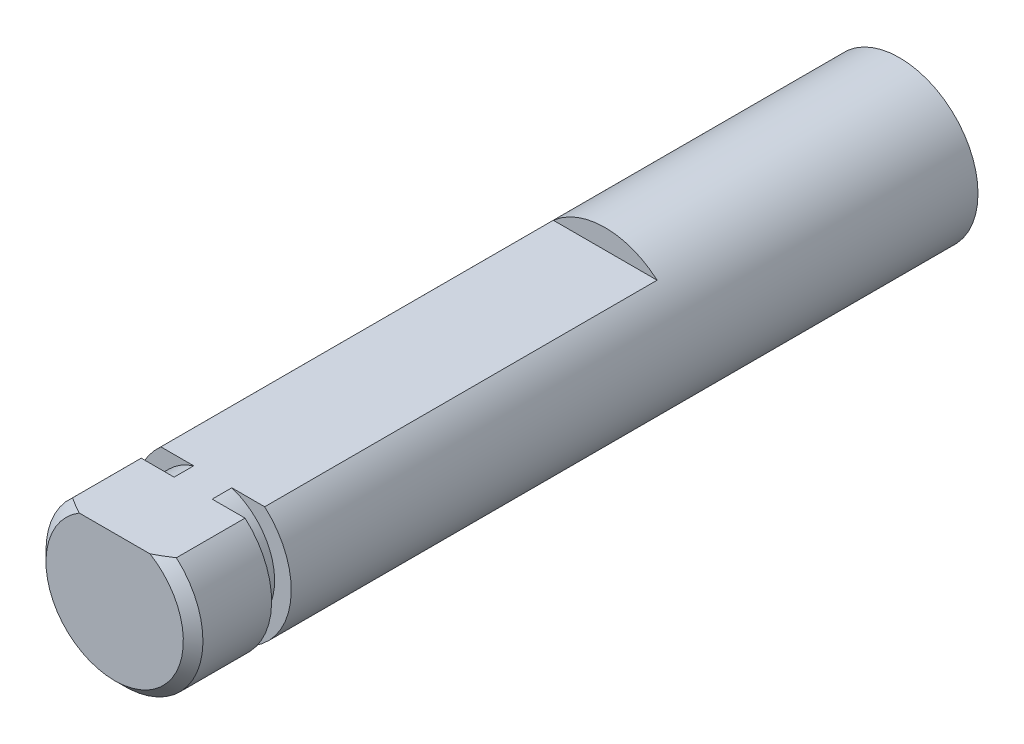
ISO-10303-21;
HEADER;
FILE_DESCRIPTION(('STEP AP214'),'2;1');
FILE_NAME('part.step','',(''),(''),'','','');
FILE_SCHEMA(('AUTOMOTIVE_DESIGN { 1 0 10303 214 1 1 1 1 }'));
ENDSEC;
DATA;
#1=APPLICATION_CONTEXT('core data for automotive mechanical design processes');
#2=APPLICATION_PROTOCOL_DEFINITION('international standard','automotive_design',2000,#1);
#3=PRODUCT_CONTEXT('',#1,'mechanical');
#4=PRODUCT('Part','Part','',(#3));
#5=PRODUCT_RELATED_PRODUCT_CATEGORY('part','',(#4));
#6=PRODUCT_DEFINITION_FORMATION('','',#4);
#7=PRODUCT_DEFINITION_CONTEXT('part definition',#1,'design');
#8=PRODUCT_DEFINITION('design','',#6,#7);
#9=PRODUCT_DEFINITION_SHAPE('','',#8);
#10=(LENGTH_UNIT() NAMED_UNIT(*) SI_UNIT(.MILLI.,.METRE.));
#11=(NAMED_UNIT(*) PLANE_ANGLE_UNIT() SI_UNIT($,.RADIAN.));
#12=(NAMED_UNIT(*) SI_UNIT($,.STERADIAN.) SOLID_ANGLE_UNIT());
#13=UNCERTAINTY_MEASURE_WITH_UNIT(LENGTH_MEASURE(1.E-05),#10,'distance_accuracy_value','');
#14=(GEOMETRIC_REPRESENTATION_CONTEXT(3) GLOBAL_UNCERTAINTY_ASSIGNED_CONTEXT((#13)) GLOBAL_UNIT_ASSIGNED_CONTEXT((#10,
#11,#12)) REPRESENTATION_CONTEXT('',''));
#15=CARTESIAN_POINT('',(0.,0.,0.));
#16=DIRECTION('',(0.,0.,1.));
#17=DIRECTION('',(1.,0.,0.));
#18=AXIS2_PLACEMENT_3D('',#15,#16,#17);
#19=CARTESIAN_POINT('',(0.,0.,40.));
#20=DIRECTION('',(0.,0.,-1.));
#21=DIRECTION('',(-1.,0.,0.));
#22=AXIS2_PLACEMENT_3D('',#19,#20,#21);
#23=CYLINDRICAL_SURFACE('',#22,4.);
#24=DIRECTION('',(0.,0.,-1.));
#25=VECTOR('',#24,1.);
#26=CARTESIAN_POINT('',(2.64575131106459,3.,40.));
#27=LINE('',#26,#25);
#28=CARTESIAN_POINT('',(2.64575131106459,3.,36.));
#29=VERTEX_POINT('',#28);
#30=CARTESIAN_POINT('',(2.64575131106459,3.,39.5));
#31=VERTEX_POINT('',#30);
#32=EDGE_CURVE('E170',#29,#31,#27,.F.);
#33=ORIENTED_EDGE('',*,*,#32,.T.);
#34=CARTESIAN_POINT('',(0.,0.,39.5));
#35=DIRECTION('',(0.,0.,1.));
#36=DIRECTION('',(1.,0.,0.));
#37=AXIS2_PLACEMENT_3D('',#34,#35,#36);
#38=CIRCLE('',#37,4.);
#39=CARTESIAN_POINT('',(-2.64575131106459,3.,39.5));
#40=VERTEX_POINT('',#39);
#41=EDGE_CURVE('E11',#31,#40,#38,.F.);
#42=ORIENTED_EDGE('',*,*,#41,.T.);
#43=DIRECTION('',(0.,0.,-1.));
#44=VECTOR('',#43,1.);
#45=CARTESIAN_POINT('',(-2.64575131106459,3.,40.));
#46=LINE('',#45,#44);
#47=CARTESIAN_POINT('',(-2.64575131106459,3.,36.));
#48=VERTEX_POINT('',#47);
#49=EDGE_CURVE('E158',#40,#48,#46,.T.);
#50=ORIENTED_EDGE('',*,*,#49,.T.);
#51=CARTESIAN_POINT('',(0.,0.,36.));
#52=DIRECTION('',(0.,0.,1.));
#53=DIRECTION('',(1.,0.,0.));
#54=AXIS2_PLACEMENT_3D('',#51,#52,#53);
#55=CIRCLE('',#54,4.);
#56=EDGE_CURVE('E171',#48,#29,#55,.T.);
#57=ORIENTED_EDGE('',*,*,#56,.T.);
#58=EDGE_LOOP('',(#33,#42,#50,#57));
#59=FACE_BOUND('',#58,.T.);
#60=ADVANCED_FACE('F31',(#59),#23,.T.);
#61=CARTESIAN_POINT('',(2.64575131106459,3.,15.));
#62=VERTEX_POINT('',#61);
#63=CARTESIAN_POINT('',(2.64575131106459,3.,35.));
#64=VERTEX_POINT('',#63);
#65=EDGE_CURVE('E153',#62,#64,#27,.F.);
#66=ORIENTED_EDGE('',*,*,#65,.T.);
#67=CARTESIAN_POINT('',(0.,0.,35.));
#68=DIRECTION('',(0.,0.,-1.));
#69=DIRECTION('',(-1.,0.,0.));
#70=AXIS2_PLACEMENT_3D('',#67,#68,#69);
#71=CIRCLE('',#70,4.);
#72=CARTESIAN_POINT('',(-2.64575131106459,3.,35.));
#73=VERTEX_POINT('',#72);
#74=EDGE_CURVE('E95',#64,#73,#71,.T.);
#75=ORIENTED_EDGE('',*,*,#74,.T.);
#76=CARTESIAN_POINT('',(-2.64575131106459,3.,15.));
#77=VERTEX_POINT('',#76);
#78=EDGE_CURVE('E161',#73,#77,#46,.T.);
#79=ORIENTED_EDGE('',*,*,#78,.T.);
#80=CARTESIAN_POINT('',(0.,0.,15.));
#81=DIRECTION('',(0.,0.,1.));
#82=DIRECTION('',(1.,0.,0.));
#83=AXIS2_PLACEMENT_3D('',#80,#81,#82);
#84=CIRCLE('',#83,4.);
#85=EDGE_CURVE('E100',#62,#77,#84,.T.);
#86=ORIENTED_EDGE('',*,*,#85,.F.);
#87=EDGE_LOOP('',(#66,#75,#79,#86));
#88=FACE_BOUND('',#87,.T.);
#89=CARTESIAN_POINT('',(0.,0.,0.));
#90=DIRECTION('',(0.,0.,1.));
#91=DIRECTION('',(1.,0.,0.));
#92=AXIS2_PLACEMENT_3D('',#89,#90,#91);
#93=CIRCLE('',#92,4.);
#94=CARTESIAN_POINT('',(4.,0.,0.));
#95=VERTEX_POINT('',#94);
#96=EDGE_CURVE('E156',#95,#95,#93,.T.);
#97=ORIENTED_EDGE('',*,*,#96,.T.);
#98=EDGE_LOOP('',(#97));
#99=FACE_BOUND('',#98,.T.);
#100=ADVANCED_FACE('F143',(#88,#99),#23,.T.);
#101=CARTESIAN_POINT('',(0.,0.,40.));
#102=DIRECTION('',(0.,0.,1.));
#103=DIRECTION('',(1.,0.,0.));
#104=AXIS2_PLACEMENT_3D('',#101,#102,#103);
#105=PLANE('',#104);
#106=DIRECTION('',(1.,0.,0.));
#107=VECTOR('',#106,1.);
#108=CARTESIAN_POINT('',(0.,3.,40.));
#109=LINE('',#108,#107);
#110=CARTESIAN_POINT('',(-1.802775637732,3.,40.));
#111=VERTEX_POINT('',#110);
#112=CARTESIAN_POINT('',(1.802775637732,3.,40.));
#113=VERTEX_POINT('',#112);
#114=EDGE_CURVE('E157',#111,#113,#109,.T.);
#115=ORIENTED_EDGE('',*,*,#114,.F.);
#116=CARTESIAN_POINT('',(0.,0.,40.));
#117=DIRECTION('',(0.,0.,1.));
#118=DIRECTION('',(1.,0.,0.));
#119=AXIS2_PLACEMENT_3D('',#116,#117,#118);
#120=CIRCLE('',#119,3.5);
#121=EDGE_CURVE('E120',#111,#113,#120,.T.);
#122=ORIENTED_EDGE('',*,*,#121,.T.);
#123=EDGE_LOOP('',(#115,#122));
#124=FACE_BOUND('',#123,.T.);
#125=ADVANCED_FACE('F138',(#124),#105,.T.);
#126=CARTESIAN_POINT('',(0.,0.,0.));
#127=DIRECTION('',(0.,0.,1.));
#128=DIRECTION('',(1.,0.,0.));
#129=AXIS2_PLACEMENT_3D('',#126,#127,#128);
#130=PLANE('',#129);
#131=ORIENTED_EDGE('',*,*,#96,.F.);
#132=EDGE_LOOP('',(#131));
#133=FACE_BOUND('',#132,.T.);
#134=ADVANCED_FACE('F142',(#133),#130,.F.);
#135=CARTESIAN_POINT('',(-2.88763339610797,3.,15.));
#136=DIRECTION('',(0.,0.,1.));
#137=DIRECTION('',(1.,0.,0.));
#138=AXIS2_PLACEMENT_3D('',#135,#136,#137);
#139=PLANE('',#138);
#140=DIRECTION('',(1.,0.,0.));
#141=VECTOR('',#140,1.);
#142=CARTESIAN_POINT('',(-2.88763339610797,3.,15.));
#143=LINE('',#142,#141);
#144=EDGE_CURVE('E168',#77,#62,#143,.T.);
#145=ORIENTED_EDGE('',*,*,#144,.T.);
#146=ORIENTED_EDGE('',*,*,#85,.T.);
#147=EDGE_LOOP('',(#145,#146));
#148=FACE_BOUND('',#147,.T.);
#149=ADVANCED_FACE('F136',(#148),#139,.T.);
#150=CARTESIAN_POINT('',(-2.88763339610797,3.,15.));
#151=DIRECTION('',(0.,-1.,0.));
#152=DIRECTION('',(0.,0.,-1.));
#153=AXIS2_PLACEMENT_3D('',#150,#151,#152);
#154=PLANE('',#153);
#155=ORIENTED_EDGE('',*,*,#114,.T.);
#156=CARTESIAN_POINT('',(1.802775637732,3.,40.));
#157=CARTESIAN_POINT('',(1.87545495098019,3.,39.962552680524));
#158=CARTESIAN_POINT('',(1.94745530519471,3.,39.9238154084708));
#159=CARTESIAN_POINT('',(2.0901648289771,3.,39.8441464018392));
#160=CARTESIAN_POINT('',(2.16087490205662,3.,39.8032162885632));
#161=CARTESIAN_POINT('',(2.30116567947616,3.,39.7194976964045));
#162=CARTESIAN_POINT('',(2.37074655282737,3.,39.6767094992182));
#163=CARTESIAN_POINT('',(2.50895192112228,3.,39.5895037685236));
#164=CARTESIAN_POINT('',(2.57757568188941,3.,39.5450850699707));
#165=CARTESIAN_POINT('',(2.64575131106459,3.,39.5));
#166=B_SPLINE_CURVE_WITH_KNOTS('',3,(#156,#157,#158,#159,#160,#161,#162,#163,#164,#165),
.UNSPECIFIED.,.F.,.F.,(4,2,2,2,4),(0.,0.245246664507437,0.490314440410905,0.73534519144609,
0.980554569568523),.UNSPECIFIED.);
#167=EDGE_CURVE('E40',#113,#31,#166,.T.);
#168=ORIENTED_EDGE('',*,*,#167,.T.);
#169=ORIENTED_EDGE('',*,*,#32,.F.);
#170=DIRECTION('',(-1.,0.,0.));
#171=VECTOR('',#170,1.);
#172=CARTESIAN_POINT('',(-2.88763339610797,3.,36.));
#173=LINE('',#172,#171);
#174=CARTESIAN_POINT('',(0.970258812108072,3.,36.));
#175=VERTEX_POINT('',#174);
#176=EDGE_CURVE('E113',#29,#175,#173,.T.);
#177=ORIENTED_EDGE('',*,*,#176,.T.);
#178=DIRECTION('',(0.,0.,1.));
#179=VECTOR('',#178,1.);
#180=CARTESIAN_POINT('',(0.970258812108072,3.,40.));
#181=LINE('',#180,#179);
#182=CARTESIAN_POINT('',(0.970258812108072,3.,35.));
#183=VERTEX_POINT('',#182);
#184=EDGE_CURVE('E99',#175,#183,#181,.F.);
#185=ORIENTED_EDGE('',*,*,#184,.T.);
#186=DIRECTION('',(1.,0.,0.));
#187=VECTOR('',#186,1.);
#188=CARTESIAN_POINT('',(-2.88763339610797,3.,35.));
#189=LINE('',#188,#187);
#190=EDGE_CURVE('E89',#183,#64,#189,.T.);
#191=ORIENTED_EDGE('',*,*,#190,.T.);
#192=ORIENTED_EDGE('',*,*,#65,.F.);
#193=ORIENTED_EDGE('',*,*,#144,.F.);
#194=ORIENTED_EDGE('',*,*,#78,.F.);
#195=CARTESIAN_POINT('',(-0.970258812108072,3.,35.));
#196=VERTEX_POINT('',#195);
#197=EDGE_CURVE('E102',#73,#196,#189,.T.);
#198=ORIENTED_EDGE('',*,*,#197,.T.);
#199=DIRECTION('',(0.,0.,1.));
#200=VECTOR('',#199,1.);
#201=CARTESIAN_POINT('',(-0.970258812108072,3.,40.));
#202=LINE('',#201,#200);
#203=CARTESIAN_POINT('',(-0.970258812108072,3.,36.));
#204=VERTEX_POINT('',#203);
#205=EDGE_CURVE('E108',#196,#204,#202,.T.);
#206=ORIENTED_EDGE('',*,*,#205,.T.);
#207=EDGE_CURVE('E116',#204,#48,#173,.T.);
#208=ORIENTED_EDGE('',*,*,#207,.T.);
#209=ORIENTED_EDGE('',*,*,#49,.F.);
#210=CARTESIAN_POINT('',(-2.64575131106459,3.,39.5));
#211=CARTESIAN_POINT('',(-2.57757568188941,3.,39.5450850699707));
#212=CARTESIAN_POINT('',(-2.50895192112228,3.,39.5895037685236));
#213=CARTESIAN_POINT('',(-2.37074655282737,3.,39.6767094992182));
#214=CARTESIAN_POINT('',(-2.30116567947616,3.,39.7194976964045));
#215=CARTESIAN_POINT('',(-2.16087490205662,3.,39.8032162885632));
#216=CARTESIAN_POINT('',(-2.0901648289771,3.,39.8441464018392));
#217=CARTESIAN_POINT('',(-1.94745530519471,3.,39.9238154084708));
#218=CARTESIAN_POINT('',(-1.87545495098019,3.,39.962552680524));
#219=CARTESIAN_POINT('',(-1.802775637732,3.,40.));
#220=B_SPLINE_CURVE_WITH_KNOTS('',3,(#210,#211,#212,#213,#214,#215,#216,#217,#218,#219),
.UNSPECIFIED.,.F.,.F.,(4,2,2,2,4),(0.,0.245209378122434,0.490240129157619,0.735307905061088,
0.980554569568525),.UNSPECIFIED.);
#221=EDGE_CURVE('E123',#40,#111,#220,.T.);
#222=ORIENTED_EDGE('',*,*,#221,.T.);
#223=EDGE_LOOP('',(#155,#168,#169,#177,#185,#191,#192,#193,#194,#198,#206,#208,#209,#222));
#224=FACE_BOUND('',#223,.T.);
#225=ADVANCED_FACE('F112',(#224),#154,.F.);
#226=CARTESIAN_POINT('',(0.,-4.99629058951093,36.));
#227=DIRECTION('',(0.,0.,1.));
#228=DIRECTION('',(1.,0.,0.));
#229=AXIS2_PLACEMENT_3D('',#226,#227,#228);
#230=PLANE('',#229);
#231=ORIENTED_EDGE('',*,*,#56,.F.);
#232=ORIENTED_EDGE('',*,*,#207,.F.);
#233=CARTESIAN_POINT('',(0.,0.,36.));
#234=DIRECTION('',(0.,0.,1.));
#235=DIRECTION('',(1.,0.,0.));
#236=AXIS2_PLACEMENT_3D('',#233,#234,#235);
#237=CIRCLE('',#236,3.15299891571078);
#238=EDGE_CURVE('E109',#204,#175,#237,.T.);
#239=ORIENTED_EDGE('',*,*,#238,.T.);
#240=ORIENTED_EDGE('',*,*,#176,.F.);
#241=EDGE_LOOP('',(#231,#232,#239,#240));
#242=FACE_BOUND('',#241,.T.);
#243=ADVANCED_FACE('F135',(#242),#230,.F.);
#244=CARTESIAN_POINT('',(0.,0.,40.));
#245=DIRECTION('',(0.,0.,1.));
#246=DIRECTION('',(1.,0.,0.));
#247=AXIS2_PLACEMENT_3D('',#244,#245,#246);
#248=CYLINDRICAL_SURFACE('',#247,3.15299891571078);
#249=ORIENTED_EDGE('',*,*,#238,.F.);
#250=ORIENTED_EDGE('',*,*,#205,.F.);
#251=CARTESIAN_POINT('',(0.,0.,35.));
#252=DIRECTION('',(0.,0.,1.));
#253=DIRECTION('',(1.,0.,0.));
#254=AXIS2_PLACEMENT_3D('',#251,#252,#253);
#255=CIRCLE('',#254,3.15299891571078);
#256=EDGE_CURVE('E92',#196,#183,#255,.T.);
#257=ORIENTED_EDGE('',*,*,#256,.T.);
#258=ORIENTED_EDGE('',*,*,#184,.F.);
#259=EDGE_LOOP('',(#249,#250,#257,#258));
#260=FACE_BOUND('',#259,.T.);
#261=ADVANCED_FACE('F105',(#260),#248,.T.);
#262=CARTESIAN_POINT('',(0.,-4.99629058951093,35.));
#263=DIRECTION('',(0.,0.,-1.));
#264=DIRECTION('',(-1.,0.,0.));
#265=AXIS2_PLACEMENT_3D('',#262,#263,#264);
#266=PLANE('',#265);
#267=ORIENTED_EDGE('',*,*,#74,.F.);
#268=ORIENTED_EDGE('',*,*,#190,.F.);
#269=ORIENTED_EDGE('',*,*,#256,.F.);
#270=ORIENTED_EDGE('',*,*,#197,.F.);
#271=EDGE_LOOP('',(#267,#268,#269,#270));
#272=FACE_BOUND('',#271,.T.);
#273=ADVANCED_FACE('F91',(#272),#266,.F.);
#274=CARTESIAN_POINT('',(0.,0.,40.));
#275=DIRECTION('',(0.,0.,-1.));
#276=DIRECTION('',(-1.,0.,0.));
#277=AXIS2_PLACEMENT_3D('',#274,#275,#276);
#278=CONICAL_SURFACE('',#277,3.5,0.785398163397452);
#279=ORIENTED_EDGE('',*,*,#221,.F.);
#280=ORIENTED_EDGE('',*,*,#41,.F.);
#281=ORIENTED_EDGE('',*,*,#167,.F.);
#282=ORIENTED_EDGE('',*,*,#121,.F.);
#283=EDGE_LOOP('',(#279,#280,#281,#282));
#284=FACE_BOUND('',#283,.T.);
#285=ADVANCED_FACE('F33',(#284),#278,.T.);
#286=CLOSED_SHELL('',(#60,#100,#125,#134,#149,#225,#243,#261,#273,#285));
#287=MANIFOLD_SOLID_BREP('B2',#286);
#288=ADVANCED_BREP_SHAPE_REPRESENTATION('',(#18,#287),#14);
#289=SHAPE_DEFINITION_REPRESENTATION(#9,#288);
ENDSEC;
END-ISO-10303-21;
